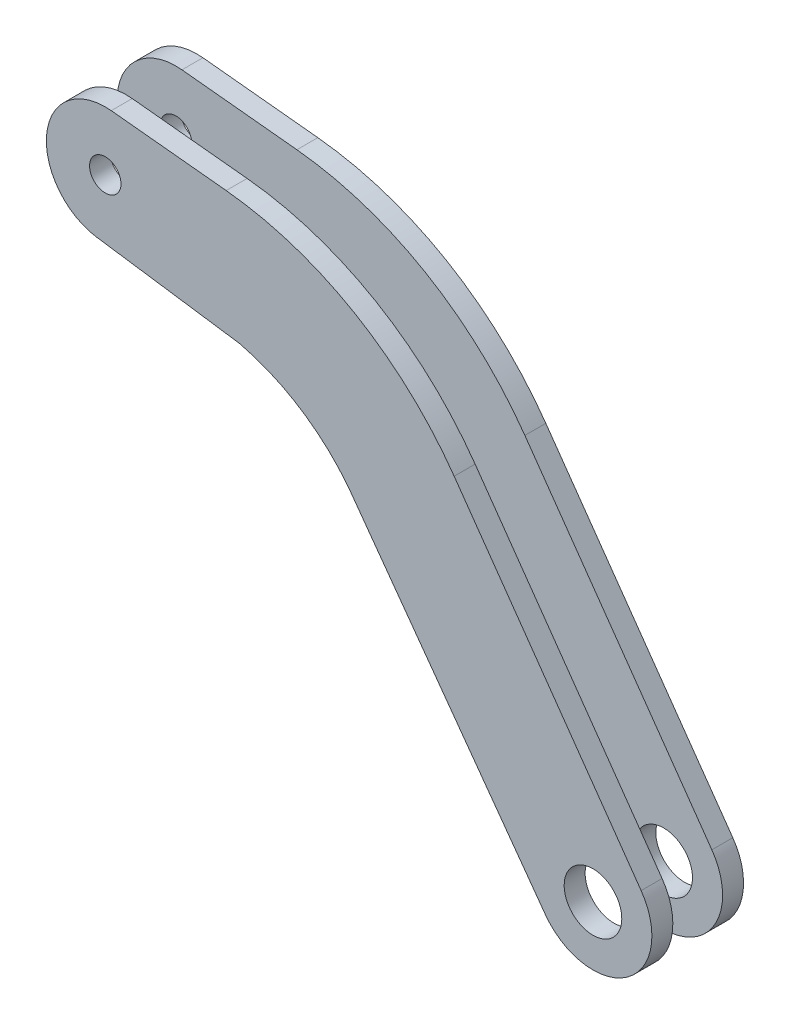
ISO-10303-21;
HEADER;
FILE_DESCRIPTION(('STEP AP214'),'2;1');
FILE_NAME('part.step','',(''),(''),'','','');
FILE_SCHEMA(('AUTOMOTIVE_DESIGN { 1 0 10303 214 1 1 1 1 }'));
ENDSEC;
DATA;
#1=APPLICATION_CONTEXT('core data for automotive mechanical design processes');
#2=APPLICATION_PROTOCOL_DEFINITION('international standard','automotive_design',2000,#1);
#3=PRODUCT_CONTEXT('',#1,'mechanical');
#4=PRODUCT('Part','Part','',(#3));
#5=PRODUCT_RELATED_PRODUCT_CATEGORY('part','',(#4));
#6=PRODUCT_DEFINITION_FORMATION('','',#4);
#7=PRODUCT_DEFINITION_CONTEXT('part definition',#1,'design');
#8=PRODUCT_DEFINITION('design','',#6,#7);
#9=PRODUCT_DEFINITION_SHAPE('','',#8);
#10=(LENGTH_UNIT() NAMED_UNIT(*) SI_UNIT(.MILLI.,.METRE.));
#11=(NAMED_UNIT(*) PLANE_ANGLE_UNIT() SI_UNIT($,.RADIAN.));
#12=(NAMED_UNIT(*) SI_UNIT($,.STERADIAN.) SOLID_ANGLE_UNIT());
#13=UNCERTAINTY_MEASURE_WITH_UNIT(LENGTH_MEASURE(1.E-05),#10,'distance_accuracy_value','');
#14=(GEOMETRIC_REPRESENTATION_CONTEXT(3) GLOBAL_UNCERTAINTY_ASSIGNED_CONTEXT((#13)) GLOBAL_UNIT_ASSIGNED_CONTEXT((#10,
#11,#12)) REPRESENTATION_CONTEXT('',''));
#15=CARTESIAN_POINT('',(0.,0.,0.));
#16=DIRECTION('',(0.,0.,1.));
#17=DIRECTION('',(1.,0.,0.));
#18=AXIS2_PLACEMENT_3D('',#15,#16,#17);
#19=CARTESIAN_POINT('',(-14.6932596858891,135.706883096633,-17.5));
#20=DIRECTION('',(0.,0.,1.));
#21=DIRECTION('',(-0.620455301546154,-0.78424181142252,0.));
#22=AXIS2_PLACEMENT_3D('',#19,#20,#21);
#23=CYLINDRICAL_SURFACE('',#22,22.5);
#24=CARTESIAN_POINT('',(-14.6932596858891,135.706883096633,-9.50000000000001));
#25=DIRECTION('',(0.,0.,1.));
#26=DIRECTION('',(-0.620455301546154,-0.78424181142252,0.));
#27=AXIS2_PLACEMENT_3D('',#24,#25,#26);
#28=CIRCLE('',#27,22.5);
#29=CARTESIAN_POINT('',(-12.407062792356,158.090432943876,-9.49999999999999));
#30=VERTEX_POINT('',#29);
#31=CARTESIAN_POINT('',(-17.9102291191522,113.438045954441,-9.50000000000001));
#32=VERTEX_POINT('',#31);
#33=EDGE_CURVE('P0_E158',#30,#32,#28,.T.);
#34=ORIENTED_EDGE('',*,*,#33,.F.);
#35=DIRECTION('',(0.,0.,-1.));
#36=VECTOR('',#35,1.);
#37=CARTESIAN_POINT('',(-12.4070627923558,158.090432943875,250.031092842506));
#38=LINE('',#37,#36);
#39=CARTESIAN_POINT('',(-12.407062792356,158.090432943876,-17.5));
#40=VERTEX_POINT('',#39);
#41=EDGE_CURVE('P0_E113',#30,#40,#38,.T.);
#42=ORIENTED_EDGE('',*,*,#41,.T.);
#43=CARTESIAN_POINT('',(-14.6932596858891,135.706883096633,-17.5));
#44=DIRECTION('',(0.,0.,1.));
#45=DIRECTION('',(-0.620455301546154,-0.78424181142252,0.));
#46=AXIS2_PLACEMENT_3D('',#43,#44,#45);
#47=CIRCLE('',#46,22.5);
#48=CARTESIAN_POINT('',(-17.9102291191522,113.438045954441,-17.5));
#49=VERTEX_POINT('',#48);
#50=EDGE_CURVE('P0_E166',#40,#49,#47,.T.);
#51=ORIENTED_EDGE('',*,*,#50,.T.);
#52=DIRECTION('',(0.,0.,-1.));
#53=VECTOR('',#52,1.);
#54=CARTESIAN_POINT('',(-17.9102291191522,113.438045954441,118.718425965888));
#55=LINE('',#54,#53);
#56=EDGE_CURVE('P0_E132',#32,#49,#55,.T.);
#57=ORIENTED_EDGE('',*,*,#56,.F.);
#58=EDGE_LOOP('',(#34,#42,#51,#57));
#59=FACE_BOUND('',#58,.T.);
#60=ADVANCED_FACE('P0_F16',(#59),#23,.T.);
#61=CARTESIAN_POINT('',(171.564170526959,-11.6512510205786,-17.5000000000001));
#62=DIRECTION('',(0.,0.,1.));
#63=DIRECTION('',(-0.620455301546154,-0.78424181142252,0.));
#64=AXIS2_PLACEMENT_3D('',#61,#62,#63);
#65=CYLINDRICAL_SURFACE('',#64,22.5);
#66=DIRECTION('',(0.,0.,-1.));
#67=VECTOR('',#66,1.);
#68=CARTESIAN_POINT('',(189.957933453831,1.30712408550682,250.031092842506));
#69=LINE('',#68,#67);
#70=CARTESIAN_POINT('',(189.957933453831,1.30712408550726,-9.50000000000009));
#71=VERTEX_POINT('',#70);
#72=CARTESIAN_POINT('',(189.957933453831,1.30712408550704,-17.5000000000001));
#73=VERTEX_POINT('',#72);
#74=EDGE_CURVE('P0_E35',#71,#73,#69,.T.);
#75=ORIENTED_EDGE('',*,*,#74,.F.);
#76=CARTESIAN_POINT('',(171.564170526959,-11.6512510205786,-9.50000000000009));
#77=DIRECTION('',(0.,0.,1.));
#78=DIRECTION('',(-0.620455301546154,-0.78424181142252,0.));
#79=AXIS2_PLACEMENT_3D('',#76,#77,#78);
#80=CIRCLE('',#79,22.5);
#81=CARTESIAN_POINT('',(153.346840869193,-24.8565113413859,-9.50000000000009));
#82=VERTEX_POINT('',#81);
#83=EDGE_CURVE('P0_E160',#82,#71,#80,.T.);
#84=ORIENTED_EDGE('',*,*,#83,.F.);
#85=DIRECTION('',(0.,0.,-1.));
#86=VECTOR('',#85,1.);
#87=CARTESIAN_POINT('',(153.346840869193,-24.8565113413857,118.718425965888));
#88=LINE('',#87,#86);
#89=CARTESIAN_POINT('',(153.346840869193,-24.8565113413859,-17.5000000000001));
#90=VERTEX_POINT('',#89);
#91=EDGE_CURVE('P0_E138',#82,#90,#88,.T.);
#92=ORIENTED_EDGE('',*,*,#91,.T.);
#93=CARTESIAN_POINT('',(171.564170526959,-11.6512510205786,-17.5000000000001));
#94=DIRECTION('',(0.,0.,1.));
#95=DIRECTION('',(-0.620455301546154,-0.78424181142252,0.));
#96=AXIS2_PLACEMENT_3D('',#93,#94,#95);
#97=CIRCLE('',#96,22.5);
#98=EDGE_CURVE('P0_E31',#90,#73,#97,.T.);
#99=ORIENTED_EDGE('',*,*,#98,.T.);
#100=EDGE_LOOP('',(#75,#84,#92,#99));
#101=FACE_BOUND('',#100,.T.);
#102=ADVANCED_FACE('P0_F212',(#101),#65,.T.);
#103=CARTESIAN_POINT('',(-14.6932596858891,135.706883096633,-17.5));
#104=DIRECTION('',(0.,0.,1.));
#105=DIRECTION('',(-0.620455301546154,-0.78424181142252,0.));
#106=AXIS2_PLACEMENT_3D('',#103,#104,#105);
#107=PLANE('',#106);
#108=ORIENTED_EDGE('',*,*,#50,.F.);
#109=DIRECTION('',(0.994824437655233,-0.101608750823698,0.));
#110=VECTOR('',#109,1.);
#111=CARTESIAN_POINT('',(-12.4070627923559,158.090432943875,-17.5));
#112=LINE('',#111,#110);
#113=CARTESIAN_POINT('',(31.485600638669,153.607351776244,-17.5));
#114=VERTEX_POINT('',#113);
#115=EDGE_CURVE('P0_E110',#40,#114,#112,.T.);
#116=ORIENTED_EDGE('',*,*,#115,.T.);
#117=CARTESIAN_POINT('',(19.1275013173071,32.6124659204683,-17.5));
#118=DIRECTION('',(0.,0.,-1.));
#119=DIRECTION('',(0.620455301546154,0.78424181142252,0.));
#120=AXIS2_PLACEMENT_3D('',#117,#118,#119);
#121=CIRCLE('',#120,121.62436031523);
#122=CARTESIAN_POINT('',(118.555485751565,102.659314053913,-17.5));
#123=VERTEX_POINT('',#122);
#124=EDGE_CURVE('P0_E95',#114,#123,#121,.T.);
#125=ORIENTED_EDGE('',*,*,#124,.T.);
#126=DIRECTION('',(0.575927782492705,-0.817500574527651,0.));
#127=VECTOR('',#126,1.);
#128=CARTESIAN_POINT('',(189.957933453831,1.30712408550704,-17.5000000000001));
#129=LINE('',#128,#127);
#130=EDGE_CURVE('P0_E108',#123,#73,#129,.T.);
#131=ORIENTED_EDGE('',*,*,#130,.T.);
#132=ORIENTED_EDGE('',*,*,#98,.F.);
#133=DIRECTION('',(-0.586900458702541,0.809659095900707,0.));
#134=VECTOR('',#133,1.);
#135=CARTESIAN_POINT('',(153.346840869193,-24.8565113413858,-17.5000000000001));
#136=LINE('',#135,#134);
#137=CARTESIAN_POINT('',(78.2135570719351,78.7936830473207,-17.5));
#138=VERTEX_POINT('',#137);
#139=EDGE_CURVE('P0_E135',#90,#138,#136,.T.);
#140=ORIENTED_EDGE('',*,*,#139,.T.);
#141=CARTESIAN_POINT('',(70.1169661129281,72.9246784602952,-17.5));
#142=DIRECTION('',(0.,0.,1.));
#143=DIRECTION('',(-0.620455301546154,-0.78424181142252,0.));
#144=AXIS2_PLACEMENT_3D('',#141,#142,#143);
#145=CIRCLE('',#144,10.);
#146=CARTESIAN_POINT('',(77.9614991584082,79.1265573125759,-17.5));
#147=VERTEX_POINT('',#146);
#148=EDGE_CURVE('P0_E11',#138,#147,#145,.T.);
#149=ORIENTED_EDGE('',*,*,#148,.T.);
#150=CARTESIAN_POINT('',(19.1275013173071,32.6124659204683,-17.5));
#151=DIRECTION('',(0.,0.,1.));
#152=DIRECTION('',(-0.620455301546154,-0.78424181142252,0.));
#153=AXIS2_PLACEMENT_3D('',#150,#151,#152);
#154=CIRCLE('',#153,75.);
#155=CARTESIAN_POINT('',(36.9286703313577,105.46930075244,-17.5));
#156=VERTEX_POINT('',#155);
#157=EDGE_CURVE('P0_E152',#156,#147,#154,.F.);
#158=ORIENTED_EDGE('',*,*,#157,.F.);
#159=CARTESIAN_POINT('',(34.5551811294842,95.7550561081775,-17.5));
#160=DIRECTION('',(0.,0.,1.));
#161=DIRECTION('',(-0.620455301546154,-0.78424181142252,0.));
#162=AXIS2_PLACEMENT_3D('',#159,#160,#161);
#163=CIRCLE('',#162,10.);
#164=CARTESIAN_POINT('',(35.9849453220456,105.652317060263,-17.5));
#165=VERTEX_POINT('',#164);
#166=EDGE_CURVE('P0_E180',#156,#165,#163,.T.);
#167=ORIENTED_EDGE('',*,*,#166,.T.);
#168=DIRECTION('',(-0.989726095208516,0.142976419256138,0.));
#169=VECTOR('',#168,1.);
#170=CARTESIAN_POINT('',(-17.9102291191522,113.438045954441,-17.5));
#171=LINE('',#170,#169);
#172=EDGE_CURVE('P0_E124',#165,#49,#171,.T.);
#173=ORIENTED_EDGE('',*,*,#172,.T.);
#174=EDGE_LOOP('',(#108,#116,#125,#131,#132,#140,#149,#158,#167,#173));
#175=FACE_BOUND('',#174,.T.);
#176=CARTESIAN_POINT('',(171.564170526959,-11.6512510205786,-17.5000000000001));
#177=DIRECTION('',(0.,0.,1.));
#178=DIRECTION('',(-0.620455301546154,-0.78424181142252,0.));
#179=AXIS2_PLACEMENT_3D('',#176,#177,#178);
#180=CIRCLE('',#179,11.);
#181=CARTESIAN_POINT('',(164.739162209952,-20.2779109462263,-17.5000000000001));
#182=VERTEX_POINT('',#181);
#183=EDGE_CURVE('P0_E146',#182,#182,#180,.T.);
#184=ORIENTED_EDGE('',*,*,#183,.T.);
#185=EDGE_LOOP('',(#184));
#186=FACE_BOUND('',#185,.T.);
#187=CARTESIAN_POINT('',(-14.6932596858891,135.706883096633,-17.5));
#188=DIRECTION('',(0.,0.,1.));
#189=DIRECTION('',(-0.620455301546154,-0.78424181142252,0.));
#190=AXIS2_PLACEMENT_3D('',#187,#188,#189);
#191=CIRCLE('',#190,6.);
#192=CARTESIAN_POINT('',(-18.4159914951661,131.001432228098,-17.5));
#193=VERTEX_POINT('',#192);
#194=EDGE_CURVE('P0_E162',#193,#193,#191,.T.);
#195=ORIENTED_EDGE('',*,*,#194,.T.);
#196=EDGE_LOOP('',(#195));
#197=FACE_BOUND('',#196,.T.);
#198=ADVANCED_FACE('P0_F106',(#175,#186,#197),#107,.F.);
#199=CARTESIAN_POINT('',(-14.6932596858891,135.706883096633,-9.50000000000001));
#200=DIRECTION('',(0.,0.,1.));
#201=DIRECTION('',(-0.620455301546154,-0.78424181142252,0.));
#202=AXIS2_PLACEMENT_3D('',#199,#200,#201);
#203=PLANE('',#202);
#204=DIRECTION('',(0.994824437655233,-0.101608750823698,0.));
#205=VECTOR('',#204,1.);
#206=CARTESIAN_POINT('',(-12.4070627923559,158.090432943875,-9.49999999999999));
#207=LINE('',#206,#205);
#208=CARTESIAN_POINT('',(31.485600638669,153.607351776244,-9.50000000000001));
#209=VERTEX_POINT('',#208);
#210=EDGE_CURVE('P0_E115',#30,#209,#207,.T.);
#211=ORIENTED_EDGE('',*,*,#210,.F.);
#212=ORIENTED_EDGE('',*,*,#33,.T.);
#213=DIRECTION('',(-0.989726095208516,0.142976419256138,0.));
#214=VECTOR('',#213,1.);
#215=CARTESIAN_POINT('',(-17.9102291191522,113.438045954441,-9.50000000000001));
#216=LINE('',#215,#214);
#217=CARTESIAN_POINT('',(35.9849453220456,105.652317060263,-9.50000000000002));
#218=VERTEX_POINT('',#217);
#219=EDGE_CURVE('P0_E129',#218,#32,#216,.T.);
#220=ORIENTED_EDGE('',*,*,#219,.F.);
#221=CARTESIAN_POINT('',(34.5551811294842,95.7550561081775,-9.50000000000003));
#222=DIRECTION('',(0.,0.,1.));
#223=DIRECTION('',(-0.620455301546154,-0.78424181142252,0.));
#224=AXIS2_PLACEMENT_3D('',#221,#222,#223);
#225=CIRCLE('',#224,10.);
#226=CARTESIAN_POINT('',(36.9286703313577,105.46930075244,-9.50000000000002));
#227=VERTEX_POINT('',#226);
#228=EDGE_CURVE('P0_E178',#218,#227,#225,.F.);
#229=ORIENTED_EDGE('',*,*,#228,.T.);
#230=CARTESIAN_POINT('',(19.1275013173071,32.6124659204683,-9.50000000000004));
#231=DIRECTION('',(0.,0.,-1.));
#232=DIRECTION('',(-0.620455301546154,-0.78424181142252,0.));
#233=AXIS2_PLACEMENT_3D('',#230,#231,#232);
#234=CIRCLE('',#233,75.);
#235=CARTESIAN_POINT('',(77.9614991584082,79.1265573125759,-9.50000000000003));
#236=VERTEX_POINT('',#235);
#237=EDGE_CURVE('P0_E149',#227,#236,#234,.T.);
#238=ORIENTED_EDGE('',*,*,#237,.T.);
#239=CARTESIAN_POINT('',(70.1169661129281,72.9246784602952,-9.50000000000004));
#240=DIRECTION('',(0.,0.,1.));
#241=DIRECTION('',(-0.620455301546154,-0.78424181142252,0.));
#242=AXIS2_PLACEMENT_3D('',#239,#240,#241);
#243=CIRCLE('',#242,10.);
#244=CARTESIAN_POINT('',(78.2135570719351,78.7936830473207,-9.50000000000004));
#245=VERTEX_POINT('',#244);
#246=EDGE_CURVE('P0_E24',#236,#245,#243,.F.);
#247=ORIENTED_EDGE('',*,*,#246,.T.);
#248=DIRECTION('',(-0.586900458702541,0.809659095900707,0.));
#249=VECTOR('',#248,1.);
#250=CARTESIAN_POINT('',(153.346840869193,-24.8565113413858,-9.50000000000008));
#251=LINE('',#250,#249);
#252=EDGE_CURVE('P0_E139',#82,#245,#251,.T.);
#253=ORIENTED_EDGE('',*,*,#252,.F.);
#254=ORIENTED_EDGE('',*,*,#83,.T.);
#255=DIRECTION('',(0.575927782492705,-0.817500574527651,0.));
#256=VECTOR('',#255,1.);
#257=CARTESIAN_POINT('',(189.957933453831,1.30712408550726,-9.50000000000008));
#258=LINE('',#257,#256);
#259=CARTESIAN_POINT('',(118.555485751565,102.659314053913,-9.50000000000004));
#260=VERTEX_POINT('',#259);
#261=EDGE_CURVE('P0_E101',#260,#71,#258,.T.);
#262=ORIENTED_EDGE('',*,*,#261,.F.);
#263=CARTESIAN_POINT('',(19.1275013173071,32.6124659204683,-9.50000000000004));
#264=DIRECTION('',(0.,0.,1.));
#265=DIRECTION('',(-0.620455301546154,-0.78424181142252,0.));
#266=AXIS2_PLACEMENT_3D('',#263,#264,#265);
#267=CIRCLE('',#266,121.62436031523);
#268=EDGE_CURVE('P0_E97',#209,#260,#267,.F.);
#269=ORIENTED_EDGE('',*,*,#268,.F.);
#270=EDGE_LOOP('',(#211,#212,#220,#229,#238,#247,#253,#254,#262,#269));
#271=FACE_BOUND('',#270,.T.);
#272=CARTESIAN_POINT('',(171.564170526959,-11.6512510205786,-9.50000000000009));
#273=DIRECTION('',(0.,0.,1.));
#274=DIRECTION('',(-0.620455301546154,-0.78424181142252,0.));
#275=AXIS2_PLACEMENT_3D('',#272,#273,#274);
#276=CIRCLE('',#275,11.);
#277=CARTESIAN_POINT('',(164.739162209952,-20.2779109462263,-9.50000000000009));
#278=VERTEX_POINT('',#277);
#279=EDGE_CURVE('P0_E142',#278,#278,#276,.T.);
#280=ORIENTED_EDGE('',*,*,#279,.F.);
#281=EDGE_LOOP('',(#280));
#282=FACE_BOUND('',#281,.T.);
#283=CARTESIAN_POINT('',(-14.6932596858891,135.706883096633,-9.50000000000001));
#284=DIRECTION('',(0.,0.,1.));
#285=DIRECTION('',(-0.620455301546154,-0.78424181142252,0.));
#286=AXIS2_PLACEMENT_3D('',#283,#284,#285);
#287=CIRCLE('',#286,6.);
#288=CARTESIAN_POINT('',(-18.4159914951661,131.001432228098,-9.50000000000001));
#289=VERTEX_POINT('',#288);
#290=EDGE_CURVE('P0_E155',#289,#289,#287,.T.);
#291=ORIENTED_EDGE('',*,*,#290,.F.);
#292=EDGE_LOOP('',(#291));
#293=FACE_BOUND('',#292,.T.);
#294=ADVANCED_FACE('P0_F184',(#271,#282,#293),#203,.T.);
#295=CARTESIAN_POINT('',(-14.6932596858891,135.706883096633,-11.5));
#296=DIRECTION('',(0.,0.,1.));
#297=DIRECTION('',(-0.620455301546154,-0.78424181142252,0.));
#298=AXIS2_PLACEMENT_3D('',#295,#296,#297);
#299=CYLINDRICAL_SURFACE('',#298,6.);
#300=ORIENTED_EDGE('',*,*,#194,.F.);
#301=EDGE_LOOP('',(#300));
#302=FACE_BOUND('',#301,.T.);
#303=ORIENTED_EDGE('',*,*,#290,.T.);
#304=EDGE_LOOP('',(#303));
#305=FACE_BOUND('',#304,.T.);
#306=ADVANCED_FACE('P0_F242',(#302,#305),#299,.F.);
#307=CARTESIAN_POINT('',(19.1275013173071,32.6124659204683,-19.5));
#308=DIRECTION('',(0.,0.,1.));
#309=DIRECTION('',(-0.620455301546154,-0.78424181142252,0.));
#310=AXIS2_PLACEMENT_3D('',#307,#308,#309);
#311=CYLINDRICAL_SURFACE('',#310,75.);
#312=ORIENTED_EDGE('',*,*,#237,.F.);
#313=DIRECTION('',(0.,0.,1.));
#314=VECTOR('',#313,1.);
#315=CARTESIAN_POINT('',(36.9286703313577,105.46930075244,-19.5));
#316=LINE('',#315,#314);
#317=EDGE_CURVE('P0_E174',#227,#156,#316,.F.);
#318=ORIENTED_EDGE('',*,*,#317,.T.);
#319=ORIENTED_EDGE('',*,*,#157,.T.);
#320=DIRECTION('',(0.,0.,1.));
#321=VECTOR('',#320,1.);
#322=CARTESIAN_POINT('',(77.9614991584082,79.1265573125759,-19.5));
#323=LINE('',#322,#321);
#324=EDGE_CURVE('P0_E171',#147,#236,#323,.T.);
#325=ORIENTED_EDGE('',*,*,#324,.T.);
#326=EDGE_LOOP('',(#312,#318,#319,#325));
#327=FACE_BOUND('',#326,.T.);
#328=ADVANCED_FACE('P0_F198',(#327),#311,.F.);
#329=CARTESIAN_POINT('',(171.564170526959,-11.6512510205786,-9.50000000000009));
#330=DIRECTION('',(0.,0.,1.));
#331=DIRECTION('',(-0.620455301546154,-0.78424181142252,0.));
#332=AXIS2_PLACEMENT_3D('',#329,#330,#331);
#333=CYLINDRICAL_SURFACE('',#332,11.);
#334=ORIENTED_EDGE('',*,*,#183,.F.);
#335=EDGE_LOOP('',(#334));
#336=FACE_BOUND('',#335,.T.);
#337=ORIENTED_EDGE('',*,*,#279,.T.);
#338=EDGE_LOOP('',(#337));
#339=FACE_BOUND('',#338,.T.);
#340=ADVANCED_FACE('P0_F232',(#336,#339),#333,.F.);
#341=CARTESIAN_POINT('',(153.346840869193,-24.8565113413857,118.718425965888));
#342=DIRECTION('',(-0.809659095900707,-0.586900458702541,0.));
#343=DIRECTION('',(0.586900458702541,-0.809659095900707,0.));
#344=AXIS2_PLACEMENT_3D('',#341,#342,#343);
#345=PLANE('',#344);
#346=ORIENTED_EDGE('',*,*,#252,.T.);
#347=DIRECTION('',(0.,0.,-1.));
#348=VECTOR('',#347,1.);
#349=CARTESIAN_POINT('',(78.2135570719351,78.7936830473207,-17.5));
#350=LINE('',#349,#348);
#351=EDGE_CURVE('P0_E176',#245,#138,#350,.T.);
#352=ORIENTED_EDGE('',*,*,#351,.T.);
#353=ORIENTED_EDGE('',*,*,#139,.F.);
#354=ORIENTED_EDGE('',*,*,#91,.F.);
#355=EDGE_LOOP('',(#346,#352,#353,#354));
#356=FACE_BOUND('',#355,.T.);
#357=ADVANCED_FACE('P0_F192',(#356),#345,.T.);
#358=CARTESIAN_POINT('',(-17.9102291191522,113.438045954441,118.718425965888));
#359=DIRECTION('',(-0.142976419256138,-0.989726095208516,0.));
#360=DIRECTION('',(0.989726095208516,-0.142976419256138,0.));
#361=AXIS2_PLACEMENT_3D('',#358,#359,#360);
#362=PLANE('',#361);
#363=ORIENTED_EDGE('',*,*,#172,.F.);
#364=DIRECTION('',(0.,0.,-1.));
#365=VECTOR('',#364,1.);
#366=CARTESIAN_POINT('',(35.9849453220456,105.652317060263,-9.50000000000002));
#367=LINE('',#366,#365);
#368=EDGE_CURVE('P0_E168',#165,#218,#367,.F.);
#369=ORIENTED_EDGE('',*,*,#368,.T.);
#370=ORIENTED_EDGE('',*,*,#219,.T.);
#371=ORIENTED_EDGE('',*,*,#56,.T.);
#372=EDGE_LOOP('',(#363,#369,#370,#371));
#373=FACE_BOUND('',#372,.T.);
#374=ADVANCED_FACE('P0_F205',(#373),#362,.T.);
#375=CARTESIAN_POINT('',(34.5551811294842,95.7550561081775,-19.5));
#376=DIRECTION('',(0.,0.,1.));
#377=DIRECTION('',(-0.620455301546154,-0.78424181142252,0.));
#378=AXIS2_PLACEMENT_3D('',#375,#376,#377);
#379=CYLINDRICAL_SURFACE('',#378,10.);
#380=ORIENTED_EDGE('',*,*,#166,.F.);
#381=ORIENTED_EDGE('',*,*,#317,.F.);
#382=ORIENTED_EDGE('',*,*,#228,.F.);
#383=ORIENTED_EDGE('',*,*,#368,.F.);
#384=EDGE_LOOP('',(#380,#381,#382,#383));
#385=FACE_BOUND('',#384,.T.);
#386=ADVANCED_FACE('P0_F201',(#385),#379,.F.);
#387=CARTESIAN_POINT('',(70.1169661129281,72.9246784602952,-19.5));
#388=DIRECTION('',(0.,0.,1.));
#389=DIRECTION('',(-0.620455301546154,-0.78424181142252,0.));
#390=AXIS2_PLACEMENT_3D('',#387,#388,#389);
#391=CYLINDRICAL_SURFACE('',#390,10.);
#392=ORIENTED_EDGE('',*,*,#148,.F.);
#393=ORIENTED_EDGE('',*,*,#351,.F.);
#394=ORIENTED_EDGE('',*,*,#246,.F.);
#395=ORIENTED_EDGE('',*,*,#324,.F.);
#396=EDGE_LOOP('',(#392,#393,#394,#395));
#397=FACE_BOUND('',#396,.T.);
#398=ADVANCED_FACE('P0_F18',(#397),#391,.F.);
#399=CARTESIAN_POINT('',(-12.4070627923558,158.090432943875,250.031092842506));
#400=DIRECTION('',(0.101608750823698,0.994824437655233,0.));
#401=DIRECTION('',(-0.994824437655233,0.101608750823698,0.));
#402=AXIS2_PLACEMENT_3D('',#399,#400,#401);
#403=PLANE('',#402);
#404=ORIENTED_EDGE('',*,*,#41,.F.);
#405=ORIENTED_EDGE('',*,*,#210,.T.);
#406=DIRECTION('',(0.,0.,-1.));
#407=VECTOR('',#406,1.);
#408=CARTESIAN_POINT('',(31.485600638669,153.607351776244,250.031092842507));
#409=LINE('',#408,#407);
#410=EDGE_CURVE('P0_E121',#209,#114,#409,.T.);
#411=ORIENTED_EDGE('',*,*,#410,.T.);
#412=ORIENTED_EDGE('',*,*,#115,.F.);
#413=EDGE_LOOP('',(#404,#405,#411,#412));
#414=FACE_BOUND('',#413,.T.);
#415=ADVANCED_FACE('P0_F211',(#414),#403,.T.);
#416=CARTESIAN_POINT('',(19.1275013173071,32.6124659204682,250.031092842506));
#417=DIRECTION('',(0.,0.,-1.));
#418=DIRECTION('',(0.620455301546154,0.78424181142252,0.));
#419=AXIS2_PLACEMENT_3D('',#416,#417,#418);
#420=CYLINDRICAL_SURFACE('',#419,121.62436031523);
#421=ORIENTED_EDGE('',*,*,#410,.F.);
#422=ORIENTED_EDGE('',*,*,#268,.T.);
#423=DIRECTION('',(0.,0.,-1.));
#424=VECTOR('',#423,1.);
#425=CARTESIAN_POINT('',(118.555485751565,102.659314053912,250.031092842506));
#426=LINE('',#425,#424);
#427=EDGE_CURVE('P0_E91',#260,#123,#426,.T.);
#428=ORIENTED_EDGE('',*,*,#427,.T.);
#429=ORIENTED_EDGE('',*,*,#124,.F.);
#430=EDGE_LOOP('',(#421,#422,#428,#429));
#431=FACE_BOUND('',#430,.T.);
#432=ADVANCED_FACE('P0_F94',(#431),#420,.T.);
#433=CARTESIAN_POINT('',(189.957933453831,1.30712408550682,250.031092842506));
#434=DIRECTION('',(0.817500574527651,0.575927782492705,0.));
#435=DIRECTION('',(-0.575927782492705,0.817500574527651,0.));
#436=AXIS2_PLACEMENT_3D('',#433,#434,#435);
#437=PLANE('',#436);
#438=ORIENTED_EDGE('',*,*,#427,.F.);
#439=ORIENTED_EDGE('',*,*,#261,.T.);
#440=ORIENTED_EDGE('',*,*,#74,.T.);
#441=ORIENTED_EDGE('',*,*,#130,.F.);
#442=EDGE_LOOP('',(#438,#439,#440,#441));
#443=FACE_BOUND('',#442,.T.);
#444=ADVANCED_FACE('P0_F112',(#443),#437,.T.);
#445=CLOSED_SHELL('',(#60,#102,#198,#294,#306,#328,#340,#357,#374,#386,#398,#415,#432,#444));
#446=MANIFOLD_SOLID_BREP('P0_B1',#445);
#447=CARTESIAN_POINT('',(-14.6932596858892,135.706883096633,17.5));
#448=DIRECTION('',(0.,0.,-1.));
#449=DIRECTION('',(-0.620455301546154,-0.78424181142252,0.));
#450=AXIS2_PLACEMENT_3D('',#447,#448,#449);
#451=CYLINDRICAL_SURFACE('',#450,22.5);
#452=CARTESIAN_POINT('',(-14.6932596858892,135.706883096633,9.49999999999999));
#453=DIRECTION('',(0.,0.,1.));
#454=DIRECTION('',(-0.620455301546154,-0.78424181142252,0.));
#455=AXIS2_PLACEMENT_3D('',#452,#453,#454);
#456=CIRCLE('',#455,22.5);
#457=CARTESIAN_POINT('',(-12.4070627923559,158.090432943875,9.5));
#458=VERTEX_POINT('',#457);
#459=CARTESIAN_POINT('',(-17.9102291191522,113.438045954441,9.49999999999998));
#460=VERTEX_POINT('',#459);
#461=EDGE_CURVE('P1_E159',#458,#460,#456,.T.);
#462=ORIENTED_EDGE('',*,*,#461,.T.);
#463=DIRECTION('',(0.,0.,1.));
#464=VECTOR('',#463,1.);
#465=CARTESIAN_POINT('',(-17.9102291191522,113.438045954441,-118.718425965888));
#466=LINE('',#465,#464);
#467=CARTESIAN_POINT('',(-17.9102291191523,113.438045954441,17.5));
#468=VERTEX_POINT('',#467);
#469=EDGE_CURVE('P1_E132',#460,#468,#466,.T.);
#470=ORIENTED_EDGE('',*,*,#469,.T.);
#471=CARTESIAN_POINT('',(-14.6932596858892,135.706883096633,17.5));
#472=DIRECTION('',(0.,0.,1.));
#473=DIRECTION('',(-0.620455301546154,-0.78424181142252,0.));
#474=AXIS2_PLACEMENT_3D('',#471,#472,#473);
#475=CIRCLE('',#474,22.5);
#476=CARTESIAN_POINT('',(-12.4070627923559,158.090432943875,17.5));
#477=VERTEX_POINT('',#476);
#478=EDGE_CURVE('P1_E168',#477,#468,#475,.T.);
#479=ORIENTED_EDGE('',*,*,#478,.F.);
#480=DIRECTION('',(0.,0.,1.));
#481=VECTOR('',#480,1.);
#482=CARTESIAN_POINT('',(-12.407062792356,158.090432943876,-250.031092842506));
#483=LINE('',#482,#481);
#484=EDGE_CURVE('P1_E114',#458,#477,#483,.T.);
#485=ORIENTED_EDGE('',*,*,#484,.F.);
#486=EDGE_LOOP('',(#462,#470,#479,#485));
#487=FACE_BOUND('',#486,.T.);
#488=ADVANCED_FACE('P1_F16',(#487),#451,.T.);
#489=CARTESIAN_POINT('',(171.564170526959,-11.6512510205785,17.4999999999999));
#490=DIRECTION('',(0.,0.,-1.));
#491=DIRECTION('',(-0.620455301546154,-0.78424181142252,0.));
#492=AXIS2_PLACEMENT_3D('',#489,#490,#491);
#493=CYLINDRICAL_SURFACE('',#492,22.5);
#494=DIRECTION('',(0.,0.,1.));
#495=VECTOR('',#494,1.);
#496=CARTESIAN_POINT('',(189.957933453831,1.30712408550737,-250.031092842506));
#497=LINE('',#496,#495);
#498=CARTESIAN_POINT('',(189.957933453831,1.30712408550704,9.49999999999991));
#499=VERTEX_POINT('',#498);
#500=CARTESIAN_POINT('',(189.957933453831,1.30712408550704,17.4999999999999));
#501=VERTEX_POINT('',#500);
#502=EDGE_CURVE('P1_E122',#499,#501,#497,.T.);
#503=ORIENTED_EDGE('',*,*,#502,.T.);
#504=CARTESIAN_POINT('',(171.564170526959,-11.6512510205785,17.4999999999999));
#505=DIRECTION('',(0.,0.,1.));
#506=DIRECTION('',(-0.620455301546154,-0.78424181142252,0.));
#507=AXIS2_PLACEMENT_3D('',#504,#505,#506);
#508=CIRCLE('',#507,22.5);
#509=CARTESIAN_POINT('',(153.346840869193,-24.8565113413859,17.4999999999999));
#510=VERTEX_POINT('',#509);
#511=EDGE_CURVE('P1_E112',#510,#501,#508,.T.);
#512=ORIENTED_EDGE('',*,*,#511,.F.);
#513=DIRECTION('',(0.,0.,1.));
#514=VECTOR('',#513,1.);
#515=CARTESIAN_POINT('',(153.346840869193,-24.856511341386,-118.718425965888));
#516=LINE('',#515,#514);
#517=CARTESIAN_POINT('',(153.346840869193,-24.8565113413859,9.49999999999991));
#518=VERTEX_POINT('',#517);
#519=EDGE_CURVE('P1_E138',#518,#510,#516,.T.);
#520=ORIENTED_EDGE('',*,*,#519,.F.);
#521=CARTESIAN_POINT('',(171.564170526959,-11.6512510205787,9.4999999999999));
#522=DIRECTION('',(0.,0.,1.));
#523=DIRECTION('',(-0.620455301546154,-0.78424181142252,0.));
#524=AXIS2_PLACEMENT_3D('',#521,#522,#523);
#525=CIRCLE('',#524,22.5);
#526=EDGE_CURVE('P1_E162',#518,#499,#525,.T.);
#527=ORIENTED_EDGE('',*,*,#526,.T.);
#528=EDGE_LOOP('',(#503,#512,#520,#527));
#529=FACE_BOUND('',#528,.T.);
#530=ADVANCED_FACE('P1_F221',(#529),#493,.T.);
#531=CARTESIAN_POINT('',(-14.6932596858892,135.706883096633,17.5));
#532=DIRECTION('',(0.,0.,-1.));
#533=DIRECTION('',(-0.620455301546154,-0.78424181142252,0.));
#534=AXIS2_PLACEMENT_3D('',#531,#532,#533);
#535=PLANE('',#534);
#536=ORIENTED_EDGE('',*,*,#478,.T.);
#537=DIRECTION('',(-0.989726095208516,0.142976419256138,0.));
#538=VECTOR('',#537,1.);
#539=CARTESIAN_POINT('',(-17.9102291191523,113.438045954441,17.5));
#540=LINE('',#539,#538);
#541=CARTESIAN_POINT('',(35.9849453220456,105.652317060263,17.5));
#542=VERTEX_POINT('',#541);
#543=EDGE_CURVE('P1_E126',#542,#468,#540,.T.);
#544=ORIENTED_EDGE('',*,*,#543,.F.);
#545=CARTESIAN_POINT('',(34.5551811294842,95.7550561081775,17.5));
#546=DIRECTION('',(0.,0.,1.));
#547=DIRECTION('',(-0.620455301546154,-0.78424181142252,0.));
#548=AXIS2_PLACEMENT_3D('',#545,#546,#547);
#549=CIRCLE('',#548,10.);
#550=CARTESIAN_POINT('',(36.9286703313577,105.46930075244,17.5));
#551=VERTEX_POINT('',#550);
#552=EDGE_CURVE('P1_E181',#551,#542,#549,.T.);
#553=ORIENTED_EDGE('',*,*,#552,.F.);
#554=CARTESIAN_POINT('',(19.1275013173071,32.6124659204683,17.5));
#555=DIRECTION('',(0.,0.,1.));
#556=DIRECTION('',(-0.620455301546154,-0.78424181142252,0.));
#557=AXIS2_PLACEMENT_3D('',#554,#555,#556);
#558=CIRCLE('',#557,75.);
#559=CARTESIAN_POINT('',(77.9614991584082,79.1265573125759,17.5));
#560=VERTEX_POINT('',#559);
#561=EDGE_CURVE('P1_E153',#551,#560,#558,.F.);
#562=ORIENTED_EDGE('',*,*,#561,.T.);
#563=CARTESIAN_POINT('',(70.1169661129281,72.9246784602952,17.5));
#564=DIRECTION('',(0.,0.,1.));
#565=DIRECTION('',(-0.620455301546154,-0.78424181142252,0.));
#566=AXIS2_PLACEMENT_3D('',#563,#564,#565);
#567=CIRCLE('',#566,10.);
#568=CARTESIAN_POINT('',(78.2135570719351,78.7936830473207,17.5));
#569=VERTEX_POINT('',#568);
#570=EDGE_CURVE('P1_E11',#569,#560,#567,.T.);
#571=ORIENTED_EDGE('',*,*,#570,.F.);
#572=DIRECTION('',(-0.586900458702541,0.809659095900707,0.));
#573=VECTOR('',#572,1.);
#574=CARTESIAN_POINT('',(153.346840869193,-24.8565113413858,17.4999999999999));
#575=LINE('',#574,#573);
#576=EDGE_CURVE('P1_E135',#510,#569,#575,.T.);
#577=ORIENTED_EDGE('',*,*,#576,.F.);
#578=ORIENTED_EDGE('',*,*,#511,.T.);
#579=DIRECTION('',(0.575927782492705,-0.817500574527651,0.));
#580=VECTOR('',#579,1.);
#581=CARTESIAN_POINT('',(189.957933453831,1.30712408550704,17.4999999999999));
#582=LINE('',#581,#580);
#583=CARTESIAN_POINT('',(118.555485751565,102.659314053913,17.5));
#584=VERTEX_POINT('',#583);
#585=EDGE_CURVE('P1_E31',#584,#501,#582,.T.);
#586=ORIENTED_EDGE('',*,*,#585,.F.);
#587=CARTESIAN_POINT('',(19.1275013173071,32.6124659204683,17.5));
#588=DIRECTION('',(0.,0.,-1.));
#589=DIRECTION('',(0.620455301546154,0.78424181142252,0.));
#590=AXIS2_PLACEMENT_3D('',#587,#588,#589);
#591=CIRCLE('',#590,121.62436031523);
#592=CARTESIAN_POINT('',(31.485600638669,153.607351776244,17.5));
#593=VERTEX_POINT('',#592);
#594=EDGE_CURVE('P1_E101',#593,#584,#591,.T.);
#595=ORIENTED_EDGE('',*,*,#594,.F.);
#596=DIRECTION('',(0.994824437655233,-0.101608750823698,0.));
#597=VECTOR('',#596,1.);
#598=CARTESIAN_POINT('',(-12.4070627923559,158.090432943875,17.5));
#599=LINE('',#598,#597);
#600=EDGE_CURVE('P1_E106',#477,#593,#599,.T.);
#601=ORIENTED_EDGE('',*,*,#600,.F.);
#602=EDGE_LOOP('',(#536,#544,#553,#562,#571,#577,#578,#586,#595,#601));
#603=FACE_BOUND('',#602,.T.);
#604=CARTESIAN_POINT('',(171.564170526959,-11.6512510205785,17.4999999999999));
#605=DIRECTION('',(0.,0.,1.));
#606=DIRECTION('',(-0.620455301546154,-0.78424181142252,0.));
#607=AXIS2_PLACEMENT_3D('',#604,#605,#606);
#608=CIRCLE('',#607,11.);
#609=CARTESIAN_POINT('',(164.739162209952,-20.2779109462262,17.4999999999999));
#610=VERTEX_POINT('',#609);
#611=EDGE_CURVE('P1_E147',#610,#610,#608,.T.);
#612=ORIENTED_EDGE('',*,*,#611,.F.);
#613=EDGE_LOOP('',(#612));
#614=FACE_BOUND('',#613,.T.);
#615=CARTESIAN_POINT('',(-14.6932596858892,135.706883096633,17.5));
#616=DIRECTION('',(0.,0.,1.));
#617=DIRECTION('',(-0.620455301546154,-0.78424181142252,0.));
#618=AXIS2_PLACEMENT_3D('',#615,#616,#617);
#619=CIRCLE('',#618,6.);
#620=CARTESIAN_POINT('',(-18.4159914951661,131.001432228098,17.5));
#621=VERTEX_POINT('',#620);
#622=EDGE_CURVE('P1_E164',#621,#621,#619,.T.);
#623=ORIENTED_EDGE('',*,*,#622,.F.);
#624=EDGE_LOOP('',(#623));
#625=FACE_BOUND('',#624,.T.);
#626=ADVANCED_FACE('P1_F109',(#603,#614,#625),#535,.F.);
#627=CARTESIAN_POINT('',(-14.6932596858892,135.706883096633,9.49999999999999));
#628=DIRECTION('',(0.,0.,-1.));
#629=DIRECTION('',(-0.620455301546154,-0.78424181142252,0.));
#630=AXIS2_PLACEMENT_3D('',#627,#628,#629);
#631=PLANE('',#630);
#632=DIRECTION('',(0.994824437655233,-0.101608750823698,0.));
#633=VECTOR('',#632,1.);
#634=CARTESIAN_POINT('',(-12.4070627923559,158.090432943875,9.5));
#635=LINE('',#634,#633);
#636=CARTESIAN_POINT('',(31.485600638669,153.607351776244,9.49999999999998));
#637=VERTEX_POINT('',#636);
#638=EDGE_CURVE('P1_E117',#458,#637,#635,.T.);
#639=ORIENTED_EDGE('',*,*,#638,.T.);
#640=CARTESIAN_POINT('',(19.1275013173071,32.6124659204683,9.49999999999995));
#641=DIRECTION('',(0.,0.,1.));
#642=DIRECTION('',(-0.620455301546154,-0.78424181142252,0.));
#643=AXIS2_PLACEMENT_3D('',#640,#641,#642);
#644=CIRCLE('',#643,121.62436031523);
#645=CARTESIAN_POINT('',(118.555485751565,102.659314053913,9.49999999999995));
#646=VERTEX_POINT('',#645);
#647=EDGE_CURVE('P1_E98',#637,#646,#644,.F.);
#648=ORIENTED_EDGE('',*,*,#647,.T.);
#649=DIRECTION('',(0.575927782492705,-0.817500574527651,0.));
#650=VECTOR('',#649,1.);
#651=CARTESIAN_POINT('',(189.957933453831,1.30712408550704,9.49999999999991));
#652=LINE('',#651,#650);
#653=EDGE_CURVE('P1_E39',#646,#499,#652,.T.);
#654=ORIENTED_EDGE('',*,*,#653,.T.);
#655=ORIENTED_EDGE('',*,*,#526,.F.);
#656=DIRECTION('',(-0.586900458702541,0.809659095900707,0.));
#657=VECTOR('',#656,1.);
#658=CARTESIAN_POINT('',(153.346840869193,-24.8565113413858,9.49999999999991));
#659=LINE('',#658,#657);
#660=CARTESIAN_POINT('',(78.2135570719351,78.7936830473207,9.49999999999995));
#661=VERTEX_POINT('',#660);
#662=EDGE_CURVE('P1_E139',#518,#661,#659,.T.);
#663=ORIENTED_EDGE('',*,*,#662,.T.);
#664=CARTESIAN_POINT('',(70.1169661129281,72.9246784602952,9.49999999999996));
#665=DIRECTION('',(0.,0.,1.));
#666=DIRECTION('',(-0.620455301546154,-0.78424181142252,0.));
#667=AXIS2_PLACEMENT_3D('',#664,#665,#666);
#668=CIRCLE('',#667,10.);
#669=CARTESIAN_POINT('',(77.9614991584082,79.1265573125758,9.49999999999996));
#670=VERTEX_POINT('',#669);
#671=EDGE_CURVE('P1_E24',#670,#661,#668,.F.);
#672=ORIENTED_EDGE('',*,*,#671,.F.);
#673=CARTESIAN_POINT('',(19.1275013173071,32.6124659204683,9.49999999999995));
#674=DIRECTION('',(0.,0.,-1.));
#675=DIRECTION('',(-0.620455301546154,-0.78424181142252,0.));
#676=AXIS2_PLACEMENT_3D('',#673,#674,#675);
#677=CIRCLE('',#676,75.);
#678=CARTESIAN_POINT('',(36.9286703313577,105.46930075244,9.49999999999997));
#679=VERTEX_POINT('',#678);
#680=EDGE_CURVE('P1_E150',#679,#670,#677,.T.);
#681=ORIENTED_EDGE('',*,*,#680,.F.);
#682=CARTESIAN_POINT('',(34.5551811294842,95.7550561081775,9.49999999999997));
#683=DIRECTION('',(0.,0.,1.));
#684=DIRECTION('',(-0.620455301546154,-0.78424181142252,0.));
#685=AXIS2_PLACEMENT_3D('',#682,#683,#684);
#686=CIRCLE('',#685,10.);
#687=CARTESIAN_POINT('',(35.9849453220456,105.652317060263,9.49999999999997));
#688=VERTEX_POINT('',#687);
#689=EDGE_CURVE('P1_E178',#688,#679,#686,.F.);
#690=ORIENTED_EDGE('',*,*,#689,.F.);
#691=DIRECTION('',(-0.989726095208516,0.142976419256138,0.));
#692=VECTOR('',#691,1.);
#693=CARTESIAN_POINT('',(-17.9102291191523,113.438045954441,9.49999999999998));
#694=LINE('',#693,#692);
#695=EDGE_CURVE('P1_E130',#688,#460,#694,.T.);
#696=ORIENTED_EDGE('',*,*,#695,.T.);
#697=ORIENTED_EDGE('',*,*,#461,.F.);
#698=EDGE_LOOP('',(#639,#648,#654,#655,#663,#672,#681,#690,#696,#697));
#699=FACE_BOUND('',#698,.T.);
#700=CARTESIAN_POINT('',(171.564170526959,-11.6512510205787,9.4999999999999));
#701=DIRECTION('',(0.,0.,1.));
#702=DIRECTION('',(-0.620455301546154,-0.78424181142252,0.));
#703=AXIS2_PLACEMENT_3D('',#700,#701,#702);
#704=CIRCLE('',#703,11.);
#705=CARTESIAN_POINT('',(164.739162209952,-20.2779109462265,9.4999999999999));
#706=VERTEX_POINT('',#705);
#707=EDGE_CURVE('P1_E142',#706,#706,#704,.T.);
#708=ORIENTED_EDGE('',*,*,#707,.T.);
#709=EDGE_LOOP('',(#708));
#710=FACE_BOUND('',#709,.T.);
#711=CARTESIAN_POINT('',(-14.6932596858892,135.706883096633,9.49999999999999));
#712=DIRECTION('',(0.,0.,1.));
#713=DIRECTION('',(-0.620455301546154,-0.78424181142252,0.));
#714=AXIS2_PLACEMENT_3D('',#711,#712,#713);
#715=CIRCLE('',#714,6.);
#716=CARTESIAN_POINT('',(-18.4159914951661,131.001432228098,9.49999999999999));
#717=VERTEX_POINT('',#716);
#718=EDGE_CURVE('P1_E156',#717,#717,#715,.T.);
#719=ORIENTED_EDGE('',*,*,#718,.T.);
#720=EDGE_LOOP('',(#719));
#721=FACE_BOUND('',#720,.T.);
#722=ADVANCED_FACE('P1_F187',(#699,#710,#721),#631,.T.);
#723=CARTESIAN_POINT('',(-14.6932596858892,135.706883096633,11.5));
#724=DIRECTION('',(0.,0.,-1.));
#725=DIRECTION('',(-0.620455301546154,-0.78424181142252,0.));
#726=AXIS2_PLACEMENT_3D('',#723,#724,#725);
#727=CYLINDRICAL_SURFACE('',#726,6.);
#728=ORIENTED_EDGE('',*,*,#622,.T.);
#729=EDGE_LOOP('',(#728));
#730=FACE_BOUND('',#729,.T.);
#731=ORIENTED_EDGE('',*,*,#718,.F.);
#732=EDGE_LOOP('',(#731));
#733=FACE_BOUND('',#732,.T.);
#734=ADVANCED_FACE('P1_F229',(#730,#733),#727,.F.);
#735=CARTESIAN_POINT('',(19.1275013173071,32.6124659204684,19.5));
#736=DIRECTION('',(0.,0.,-1.));
#737=DIRECTION('',(-0.620455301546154,-0.78424181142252,0.));
#738=AXIS2_PLACEMENT_3D('',#735,#736,#737);
#739=CYLINDRICAL_SURFACE('',#738,75.);
#740=ORIENTED_EDGE('',*,*,#680,.T.);
#741=DIRECTION('',(0.,0.,-1.));
#742=VECTOR('',#741,1.);
#743=CARTESIAN_POINT('',(77.9614991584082,79.1265573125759,19.4999999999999));
#744=LINE('',#743,#742);
#745=EDGE_CURVE('P1_E172',#560,#670,#744,.T.);
#746=ORIENTED_EDGE('',*,*,#745,.F.);
#747=ORIENTED_EDGE('',*,*,#561,.F.);
#748=DIRECTION('',(0.,0.,-1.));
#749=VECTOR('',#748,1.);
#750=CARTESIAN_POINT('',(36.9286703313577,105.46930075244,19.5));
#751=LINE('',#750,#749);
#752=EDGE_CURVE('P1_E174',#679,#551,#751,.F.);
#753=ORIENTED_EDGE('',*,*,#752,.F.);
#754=EDGE_LOOP('',(#740,#746,#747,#753));
#755=FACE_BOUND('',#754,.T.);
#756=ADVANCED_FACE('P1_F197',(#755),#739,.F.);
#757=CARTESIAN_POINT('',(171.564170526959,-11.6512510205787,9.4999999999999));
#758=DIRECTION('',(0.,0.,-1.));
#759=DIRECTION('',(-0.620455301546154,-0.78424181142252,0.));
#760=AXIS2_PLACEMENT_3D('',#757,#758,#759);
#761=CYLINDRICAL_SURFACE('',#760,11.);
#762=ORIENTED_EDGE('',*,*,#611,.T.);
#763=EDGE_LOOP('',(#762));
#764=FACE_BOUND('',#763,.T.);
#765=ORIENTED_EDGE('',*,*,#707,.F.);
#766=EDGE_LOOP('',(#765));
#767=FACE_BOUND('',#766,.T.);
#768=ADVANCED_FACE('P1_F240',(#764,#767),#761,.F.);
#769=CARTESIAN_POINT('',(153.346840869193,-24.856511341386,-118.718425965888));
#770=DIRECTION('',(-0.809659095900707,-0.586900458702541,0.));
#771=DIRECTION('',(0.586900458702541,-0.809659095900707,0.));
#772=AXIS2_PLACEMENT_3D('',#769,#770,#771);
#773=PLANE('',#772);
#774=ORIENTED_EDGE('',*,*,#662,.F.);
#775=ORIENTED_EDGE('',*,*,#519,.T.);
#776=ORIENTED_EDGE('',*,*,#576,.T.);
#777=DIRECTION('',(0.,0.,1.));
#778=VECTOR('',#777,1.);
#779=CARTESIAN_POINT('',(78.2135570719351,78.7936830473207,17.5));
#780=LINE('',#779,#778);
#781=EDGE_CURVE('P1_E176',#661,#569,#780,.T.);
#782=ORIENTED_EDGE('',*,*,#781,.F.);
#783=EDGE_LOOP('',(#774,#775,#776,#782));
#784=FACE_BOUND('',#783,.T.);
#785=ADVANCED_FACE('P1_F191',(#784),#773,.T.);
#786=CARTESIAN_POINT('',(-17.9102291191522,113.438045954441,-118.718425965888));
#787=DIRECTION('',(-0.142976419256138,-0.989726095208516,0.));
#788=DIRECTION('',(0.989726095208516,-0.142976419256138,0.));
#789=AXIS2_PLACEMENT_3D('',#786,#787,#788);
#790=PLANE('',#789);
#791=ORIENTED_EDGE('',*,*,#543,.T.);
#792=ORIENTED_EDGE('',*,*,#469,.F.);
#793=ORIENTED_EDGE('',*,*,#695,.F.);
#794=DIRECTION('',(0.,0.,1.));
#795=VECTOR('',#794,1.);
#796=CARTESIAN_POINT('',(35.9849453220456,105.652317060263,9.49999999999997));
#797=LINE('',#796,#795);
#798=EDGE_CURVE('P1_E170',#542,#688,#797,.F.);
#799=ORIENTED_EDGE('',*,*,#798,.F.);
#800=EDGE_LOOP('',(#791,#792,#793,#799));
#801=FACE_BOUND('',#800,.T.);
#802=ADVANCED_FACE('P1_F205',(#801),#790,.T.);
#803=CARTESIAN_POINT('',(34.5551811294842,95.7550561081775,19.5));
#804=DIRECTION('',(0.,0.,-1.));
#805=DIRECTION('',(-0.620455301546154,-0.78424181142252,0.));
#806=AXIS2_PLACEMENT_3D('',#803,#804,#805);
#807=CYLINDRICAL_SURFACE('',#806,10.);
#808=ORIENTED_EDGE('',*,*,#552,.T.);
#809=ORIENTED_EDGE('',*,*,#798,.T.);
#810=ORIENTED_EDGE('',*,*,#689,.T.);
#811=ORIENTED_EDGE('',*,*,#752,.T.);
#812=EDGE_LOOP('',(#808,#809,#810,#811));
#813=FACE_BOUND('',#812,.T.);
#814=ADVANCED_FACE('P1_F203',(#813),#807,.F.);
#815=CARTESIAN_POINT('',(70.1169661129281,72.9246784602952,19.5));
#816=DIRECTION('',(0.,0.,-1.));
#817=DIRECTION('',(-0.620455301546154,-0.78424181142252,0.));
#818=AXIS2_PLACEMENT_3D('',#815,#816,#817);
#819=CYLINDRICAL_SURFACE('',#818,10.);
#820=ORIENTED_EDGE('',*,*,#570,.T.);
#821=ORIENTED_EDGE('',*,*,#745,.T.);
#822=ORIENTED_EDGE('',*,*,#671,.T.);
#823=ORIENTED_EDGE('',*,*,#781,.T.);
#824=EDGE_LOOP('',(#820,#821,#822,#823));
#825=FACE_BOUND('',#824,.T.);
#826=ADVANCED_FACE('P1_F18',(#825),#819,.F.);
#827=CARTESIAN_POINT('',(-12.407062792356,158.090432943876,-250.031092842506));
#828=DIRECTION('',(0.101608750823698,0.994824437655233,0.));
#829=DIRECTION('',(-0.994824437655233,0.101608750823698,0.));
#830=AXIS2_PLACEMENT_3D('',#827,#828,#829);
#831=PLANE('',#830);
#832=ORIENTED_EDGE('',*,*,#484,.T.);
#833=ORIENTED_EDGE('',*,*,#600,.T.);
#834=DIRECTION('',(0.,0.,1.));
#835=VECTOR('',#834,1.);
#836=CARTESIAN_POINT('',(31.485600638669,153.607351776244,-250.031092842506));
#837=LINE('',#836,#835);
#838=EDGE_CURVE('P1_E103',#637,#593,#837,.T.);
#839=ORIENTED_EDGE('',*,*,#838,.F.);
#840=ORIENTED_EDGE('',*,*,#638,.F.);
#841=EDGE_LOOP('',(#832,#833,#839,#840));
#842=FACE_BOUND('',#841,.T.);
#843=ADVANCED_FACE('P1_F210',(#842),#831,.T.);
#844=CARTESIAN_POINT('',(19.1275013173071,32.6124659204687,-250.031092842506));
#845=DIRECTION('',(0.,0.,1.));
#846=DIRECTION('',(0.620455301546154,0.78424181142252,0.));
#847=AXIS2_PLACEMENT_3D('',#844,#845,#846);
#848=CYLINDRICAL_SURFACE('',#847,121.62436031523);
#849=ORIENTED_EDGE('',*,*,#838,.T.);
#850=ORIENTED_EDGE('',*,*,#594,.T.);
#851=DIRECTION('',(0.,0.,1.));
#852=VECTOR('',#851,1.);
#853=CARTESIAN_POINT('',(118.555485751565,102.659314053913,-250.031092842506));
#854=LINE('',#853,#852);
#855=EDGE_CURVE('P1_E93',#646,#584,#854,.T.);
#856=ORIENTED_EDGE('',*,*,#855,.F.);
#857=ORIENTED_EDGE('',*,*,#647,.F.);
#858=EDGE_LOOP('',(#849,#850,#856,#857));
#859=FACE_BOUND('',#858,.T.);
#860=ADVANCED_FACE('P1_F102',(#859),#848,.T.);
#861=CARTESIAN_POINT('',(189.957933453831,1.30712408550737,-250.031092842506));
#862=DIRECTION('',(0.817500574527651,0.575927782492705,0.));
#863=DIRECTION('',(-0.575927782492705,0.817500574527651,0.));
#864=AXIS2_PLACEMENT_3D('',#861,#862,#863);
#865=PLANE('',#864);
#866=ORIENTED_EDGE('',*,*,#855,.T.);
#867=ORIENTED_EDGE('',*,*,#585,.T.);
#868=ORIENTED_EDGE('',*,*,#502,.F.);
#869=ORIENTED_EDGE('',*,*,#653,.F.);
#870=EDGE_LOOP('',(#866,#867,#868,#869));
#871=FACE_BOUND('',#870,.T.);
#872=ADVANCED_FACE('P1_F95',(#871),#865,.T.);
#873=CLOSED_SHELL('',(#488,#530,#626,#722,#734,#756,#768,#785,#802,#814,#826,#843,#860,#872));
#874=MANIFOLD_SOLID_BREP('P1_B1',#873);
#875=ADVANCED_BREP_SHAPE_REPRESENTATION('',(#18,#446,#874),#14);
#876=SHAPE_DEFINITION_REPRESENTATION(#9,#875);
ENDSEC;
END-ISO-10303-21;
